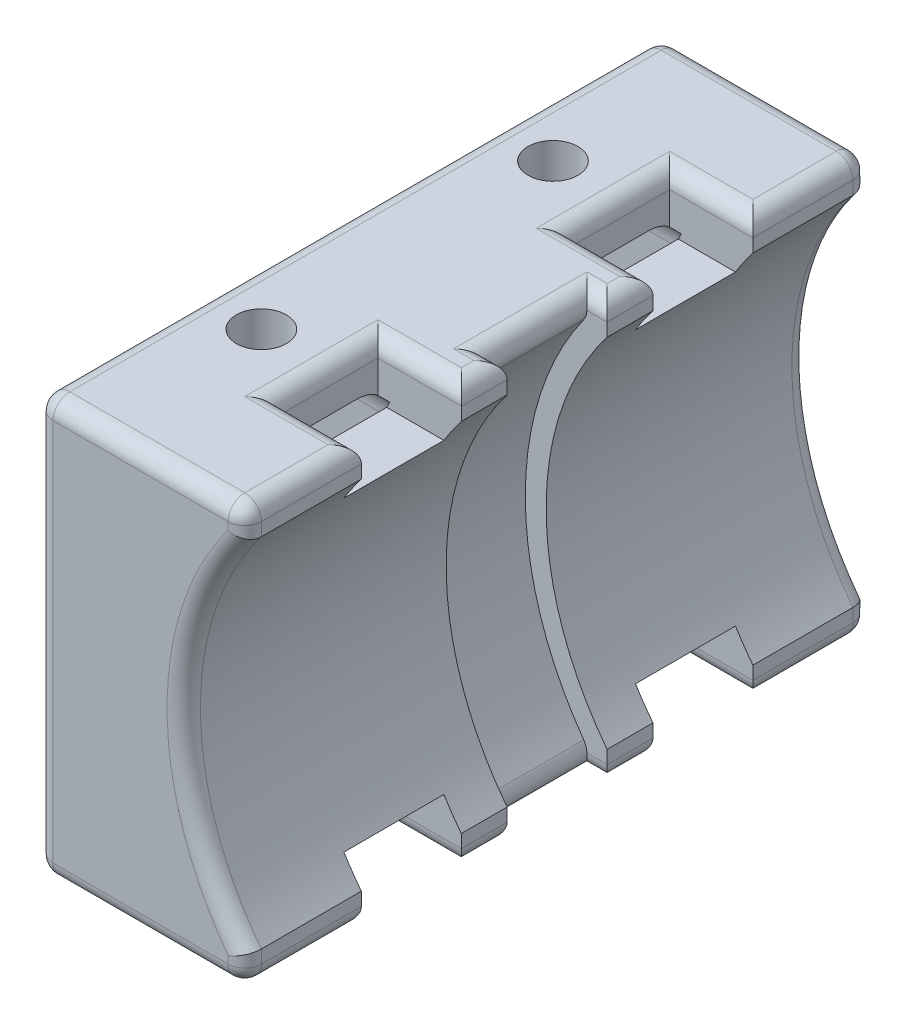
from build123d import *

# Parameters (mm, degrees)
SKETCH1_W                   = 95.25
SKETCH1_H                   = 63.5
BOSS_EXTRUDE1_DEPTH         = 31.75
SKETCH2_R                   = 44.45
CUT_EXTRUDE1_DEPTH          = 106.302837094
CUT_EXTRUDE2_REACH          = 107.303
CUT_EXTRUDE2_END_RADIUS     = 52.07
SKETCH4_R                   = 3.81
CUT_EXTRUDE3_DEPTH          = 15.24
CUT_EXTRUDE4_DEPTH          = 7.62
CUT_EXTRUDE4_DEPTH_BACK     = 7.62
SKETCH5_R                   = 47.625
SKETCH6_W                   = 12.7
SKETCH6_H                   = 15.24
CUT_EXTRUDE5_DEPTH          = 8.382
F_1_4_20_TAPPED_HOLE1_D     = 5.1054
F_1_4_20_TAPPED_HOLE1_DEPTH = 16.51
F_1_4_20_TAPPED_HOLE1_TIP   = 1.533816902
FILLET1_R                   = 2.54


with BuildPart() as part:
    # Sketch1 → Boss-Extrude1 (new body)
    with BuildSketch(Plane(origin=(0, 0, 0), x_dir=(0, 0, -1), z_dir=(1, 0, 0))):
        with Locations((47.625, 0)):
            Rectangle(SKETCH1_W, SKETCH1_H)
    extrude(amount=BOSS_EXTRUDE1_DEPTH)

    # Sketch2 → Cut-Extrude1 (cut, through all)
    with BuildSketch(Plane.XY):
        with Locations((66.9036, 0)):
            Circle(SKETCH2_R)
    extrude(amount=-CUT_EXTRUDE1_DEPTH, mode=Mode.SUBTRACT)

    # Cut-Extrude2: up to this cylinder (the profile starts outside it)
    cut_extrude2_end = Plane(origin=(66.9036, 0, -47.625), z_dir=(0, 0, 1)) * Cylinder(CUT_EXTRUDE2_END_RADIUS, 364.196, mode=Mode.PRIVATE)
    # Sketch3 → Cut-Extrude2 (cut, up to the surface)
    with BuildSketch(Plane.ZY, mode=Mode.PRIVATE) as cut_extrude2_sk1:
        with BuildLine():
            Line((-74.295, 25.4), (-65.405, 25.4))
            ThreePointArc((-65.405, 25.4), (-61.812897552, 23.912102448), (-60.325, 20.32))
            Line((-60.325, 20.32), (-60.325, -20.32))
            ThreePointArc((-60.325, -20.32), (-61.812897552, -23.912102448), (-65.405, -25.4))
            Line((-65.405, -25.4), (-74.295, -25.4))
            ThreePointArc((-74.295, -25.4), (-77.887102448, -23.912102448), (-79.375, -20.32))
            Line((-79.375, -20.32), (-79.375, 20.32))
            ThreePointArc((-79.375, 20.32), (-77.887102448, 23.912102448), (-74.295, 25.4))
        make_face()
    cut_extrude2_tool1 = extrude(cut_extrude2_sk1.sketch, amount=-CUT_EXTRUDE2_REACH, mode=Mode.PRIVATE) - cut_extrude2_end
    add(cut_extrude2_tool1.solids().sort_by_distance((0, 0, -69.85))[0], mode=Mode.SUBTRACT)
    # Sketch3 → Cut-Extrude2 (cut, up to the surface)
    with BuildSketch(Plane.ZY, mode=Mode.PRIVATE) as cut_extrude2_sk2:
        with BuildLine():
            Line((-34.925, 20.32), (-34.925, -20.32))
            ThreePointArc((-34.925, -20.32), (-33.437102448, -23.912102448), (-29.845, -25.4))
            Line((-29.845, -25.4), (-20.955, -25.4))
            ThreePointArc((-20.955, -25.4), (-17.362897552, -23.912102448), (-15.875, -20.32))
            Line((-15.875, -20.32), (-15.875, 20.32))
            ThreePointArc((-15.875, 20.32), (-17.362897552, 23.912102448), (-20.955, 25.4))
            Line((-20.955, 25.4), (-29.845, 25.4))
            ThreePointArc((-29.845, 25.4), (-33.437102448, 23.912102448), (-34.925, 20.32))
        make_face()
    cut_extrude2_tool2 = extrude(cut_extrude2_sk2.sketch, amount=-CUT_EXTRUDE2_REACH, mode=Mode.PRIVATE) - cut_extrude2_end
    add(cut_extrude2_tool2.solids().sort_by_distance((0, 0, -25.4))[0], mode=Mode.SUBTRACT)

    # Sketch4 → Cut-Extrude3 (cut)
    with BuildSketch(Plane(origin=(0, 31.75, 0), x_dir=(1, 0, 0), z_dir=(0, 1, 0))):
        with Locations(Location((8.89, 69.85, 0), (0, 0, 270))):
            Circle(SKETCH4_R)
        with Locations(Location((8.89, 25.4, 0), (0, 0, 270))):
            Circle(SKETCH4_R)
    extrude(amount=-CUT_EXTRUDE3_DEPTH, mode=Mode.SUBTRACT)

    # Sketch5 → Cut-Extrude4 (cut, two sides: drawn at the far end of the back side and taken through both)
    with BuildSketch(Plane.XY.offset(-47.625).offset(-CUT_EXTRUDE4_DEPTH_BACK)):
        with Locations((66.9036, 0)):
            Circle(SKETCH5_R)
    extrude(amount=CUT_EXTRUDE4_DEPTH + CUT_EXTRUDE4_DEPTH_BACK, mode=Mode.SUBTRACT)

    # Sketch6 → Cut-Extrude5 (cut)
    with BuildSketch(Plane.XZ.offset(31.75)):
        with Locations((25.4, -25.4)):
            Rectangle(SKETCH6_W, SKETCH6_H)
        with Locations((25.4, -69.85)):
            Rectangle(SKETCH6_W, SKETCH6_H)
    cut_extrude5 = extrude(amount=-CUT_EXTRUDE5_DEPTH, mode=Mode.SUBTRACT)

    # Mirror1: Cut-Extrude5 across plane
    add(cut_extrude5.mirror(Plane.ZX), mode=Mode.SUBTRACT)

    # 1_4-20 Tapped Hole1
    with Locations(Plane.ZY):
        with Locations((-85.725, 22.225), (-85.725, -22.225), (-47.625, 0), (-47.625, -12.7), (-47.625, 12.7), (-9.525, 22.225), (-9.525, -22.225)):
            Hole(F_1_4_20_TAPPED_HOLE1_D / 2, depth=F_1_4_20_TAPPED_HOLE1_DEPTH)
            with Locations((0, 0, -(F_1_4_20_TAPPED_HOLE1_DEPTH + F_1_4_20_TAPPED_HOLE1_TIP / 2))):  # 118° drill point
                Cone(0, F_1_4_20_TAPPED_HOLE1_D / 2, F_1_4_20_TAPPED_HOLE1_TIP, mode=Mode.SUBTRACT)

    # Fillet1
    fillet1_edges = [part.edges().sort_by_distance(p)[0] for p in [
        (31.75, -29.476717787, -95.25),
        (31.75, -31.75, -36.5125),
        (19.05, -31.75, -25.4),
        (25.4, -31.75, -33.02),
        (25.4, -31.75, -17.78),
        (31.75, -31.75, -86.36),
        (31.75, 31.75, -86.36),
        (31.75, -29.476717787, 0),
        (25.4, -31.75, -77.47),
        (25.4, -31.75, -62.23),
        (19.05, -31.75, -69.85),
        (31.75, 29.476717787, -95.25),
        (31.75, 31.75, -8.89),
        (19.05, 31.75, -25.4),
        (25.4, 31.75, -33.02),
        (25.4, 31.75, -17.78),
        (22.4536, 0, -95.25),
        (22.4536, 0, 0),
        (31.75, 31.75, -58.7375),
        (19.05, 31.75, -69.85),
        (25.4, 31.75, -77.47),
        (25.4, 31.75, -62.23),
        (31.75, 29.476717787, 0),
        (0, 31.75, -47.625),
        (0, 0, -95.25),
        (0, -31.75, -47.625),
        (0, 0, 0),
        (31.75, -31.75, -8.89),
        (15.875, 31.75, 0),
        (15.875, 31.75, -95.25),
        (15.875, -31.75, -95.25),
        (15.875, -31.75, 0),
        (31.75, 31.75, -36.5125),
        (31.406020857, 31.75, -47.625),
        (31.75, -31.75, -58.7375),
        (31.578010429, -31.75, -40.005),
        (31.578010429, 31.75, -40.005),
        (31.406020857, -31.75, -47.625),
        (31.578010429, -31.75, -55.245),
        (31.578010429, 31.75, -55.245),
    ]]
    fillet(fillet1_edges, radius=FILLET1_R)


solid = part.part
